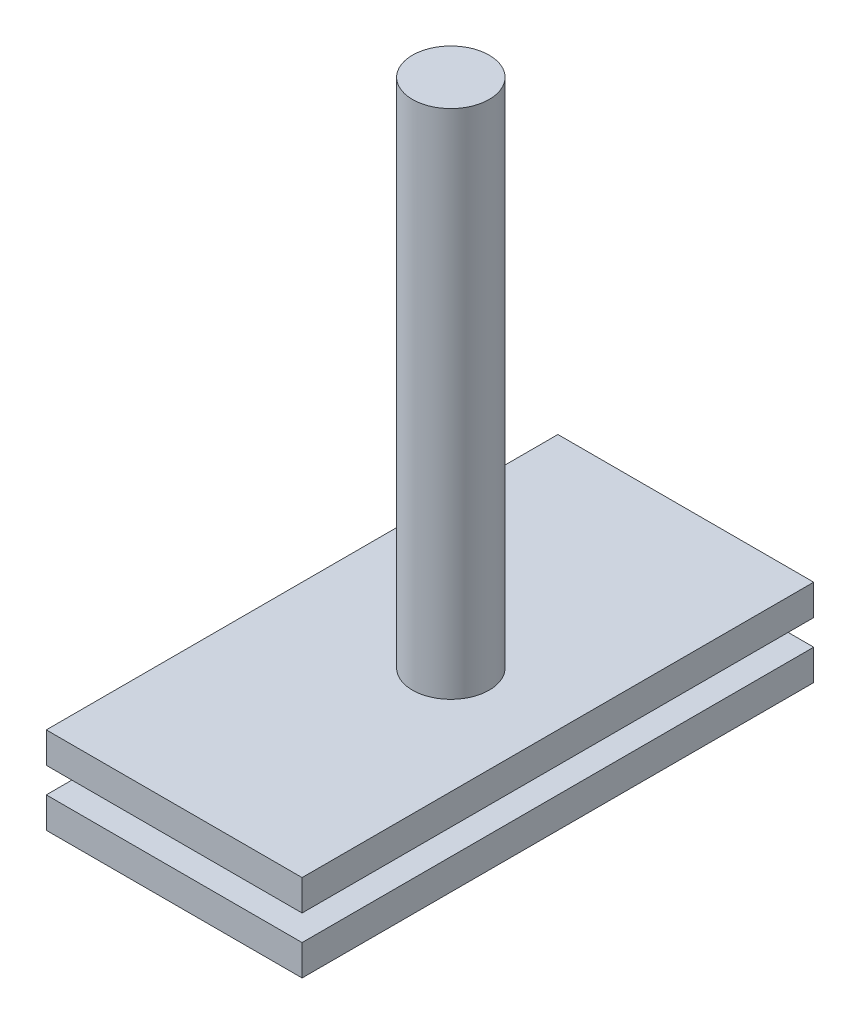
ISO-10303-21;
HEADER;
FILE_DESCRIPTION(('STEP AP214'),'2;1');
FILE_NAME('part.step','',(''),(''),'','','');
FILE_SCHEMA(('AUTOMOTIVE_DESIGN { 1 0 10303 214 1 1 1 1 }'));
ENDSEC;
DATA;
#1=APPLICATION_CONTEXT('core data for automotive mechanical design processes');
#2=APPLICATION_PROTOCOL_DEFINITION('international standard','automotive_design',2000,#1);
#3=PRODUCT_CONTEXT('',#1,'mechanical');
#4=PRODUCT('Part','Part','',(#3));
#5=PRODUCT_RELATED_PRODUCT_CATEGORY('part','',(#4));
#6=PRODUCT_DEFINITION_FORMATION('','',#4);
#7=PRODUCT_DEFINITION_CONTEXT('part definition',#1,'design');
#8=PRODUCT_DEFINITION('design','',#6,#7);
#9=PRODUCT_DEFINITION_SHAPE('','',#8);
#10=(LENGTH_UNIT() NAMED_UNIT(*) SI_UNIT(.MILLI.,.METRE.));
#11=(NAMED_UNIT(*) PLANE_ANGLE_UNIT() SI_UNIT($,.RADIAN.));
#12=(NAMED_UNIT(*) SI_UNIT($,.STERADIAN.) SOLID_ANGLE_UNIT());
#13=UNCERTAINTY_MEASURE_WITH_UNIT(LENGTH_MEASURE(1.E-05),#10,'distance_accuracy_value','');
#14=(GEOMETRIC_REPRESENTATION_CONTEXT(3) GLOBAL_UNCERTAINTY_ASSIGNED_CONTEXT((#13)) GLOBAL_UNIT_ASSIGNED_CONTEXT((#10,
#11,#12)) REPRESENTATION_CONTEXT('',''));
#15=CARTESIAN_POINT('',(0.,0.,0.));
#16=DIRECTION('',(0.,0.,1.));
#17=DIRECTION('',(1.,0.,0.));
#18=AXIS2_PLACEMENT_3D('',#15,#16,#17);
#19=CARTESIAN_POINT('',(-10.,2.2,20.));
#20=DIRECTION('',(1.,0.,0.));
#21=DIRECTION('',(0.,0.,-1.));
#22=AXIS2_PLACEMENT_3D('',#19,#20,#21);
#23=PLANE('',#22);
#24=DIRECTION('',(0.,-1.,0.));
#25=VECTOR('',#24,1.);
#26=CARTESIAN_POINT('',(-10.,2.2,0.));
#27=LINE('',#26,#25);
#28=CARTESIAN_POINT('',(-10.,2.2,0.));
#29=VERTEX_POINT('',#28);
#30=CARTESIAN_POINT('',(-10.,0.999999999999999,0.));
#31=VERTEX_POINT('',#30);
#32=EDGE_CURVE('E110',#29,#31,#27,.T.);
#33=ORIENTED_EDGE('',*,*,#32,.T.);
#34=DIRECTION('',(0.,0.,-1.));
#35=VECTOR('',#34,1.);
#36=CARTESIAN_POINT('',(-10.,0.999999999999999,20.));
#37=LINE('',#36,#35);
#38=CARTESIAN_POINT('',(-10.,0.999999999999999,20.));
#39=VERTEX_POINT('',#38);
#40=EDGE_CURVE('E52',#39,#31,#37,.T.);
#41=ORIENTED_EDGE('',*,*,#40,.F.);
#42=DIRECTION('',(0.,-1.,0.));
#43=VECTOR('',#42,1.);
#44=CARTESIAN_POINT('',(-10.,2.2,20.));
#45=LINE('',#44,#43);
#46=CARTESIAN_POINT('',(-10.,2.2,20.));
#47=VERTEX_POINT('',#46);
#48=EDGE_CURVE('E96',#47,#39,#45,.T.);
#49=ORIENTED_EDGE('',*,*,#48,.F.);
#50=DIRECTION('',(0.,0.,-1.));
#51=VECTOR('',#50,1.);
#52=CARTESIAN_POINT('',(-10.,2.2,20.));
#53=LINE('',#52,#51);
#54=EDGE_CURVE('E106',#47,#29,#53,.T.);
#55=ORIENTED_EDGE('',*,*,#54,.T.);
#56=EDGE_LOOP('',(#33,#41,#49,#55));
#57=FACE_BOUND('',#56,.T.);
#58=ADVANCED_FACE('F44',(#57),#23,.F.);
#59=CARTESIAN_POINT('',(-10.,0.999999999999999,20.));
#60=DIRECTION('',(0.,1.,0.));
#61=DIRECTION('',(0.,0.,1.));
#62=AXIS2_PLACEMENT_3D('',#59,#60,#61);
#63=PLANE('',#62);
#64=DIRECTION('',(1.,0.,0.));
#65=VECTOR('',#64,1.);
#66=CARTESIAN_POINT('',(-10.,0.999999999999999,0.));
#67=LINE('',#66,#65);
#68=CARTESIAN_POINT('',(0.,0.999999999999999,0.));
#69=VERTEX_POINT('',#68);
#70=EDGE_CURVE('E101',#31,#69,#67,.T.);
#71=ORIENTED_EDGE('',*,*,#70,.T.);
#72=DIRECTION('',(0.,0.,-1.));
#73=VECTOR('',#72,1.);
#74=CARTESIAN_POINT('',(0.,0.999999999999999,20.));
#75=LINE('',#74,#73);
#76=CARTESIAN_POINT('',(0.,0.999999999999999,20.));
#77=VERTEX_POINT('',#76);
#78=EDGE_CURVE('E99',#77,#69,#75,.T.);
#79=ORIENTED_EDGE('',*,*,#78,.F.);
#80=DIRECTION('',(1.,0.,0.));
#81=VECTOR('',#80,1.);
#82=CARTESIAN_POINT('',(-10.,0.999999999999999,20.));
#83=LINE('',#82,#81);
#84=EDGE_CURVE('E91',#39,#77,#83,.T.);
#85=ORIENTED_EDGE('',*,*,#84,.F.);
#86=ORIENTED_EDGE('',*,*,#40,.T.);
#87=EDGE_LOOP('',(#71,#79,#85,#86));
#88=FACE_BOUND('',#87,.T.);
#89=ADVANCED_FACE('F100',(#88),#63,.F.);
#90=CARTESIAN_POINT('',(0.,2.2,20.));
#91=DIRECTION('',(-1.,0.,0.));
#92=DIRECTION('',(0.,-1.,0.));
#93=AXIS2_PLACEMENT_3D('',#90,#91,#92);
#94=PLANE('',#93);
#95=DIRECTION('',(0.,1.,0.));
#96=VECTOR('',#95,1.);
#97=CARTESIAN_POINT('',(0.,2.2,0.));
#98=LINE('',#97,#96);
#99=CARTESIAN_POINT('',(0.,2.2,0.));
#100=VERTEX_POINT('',#99);
#101=EDGE_CURVE('E77',#69,#100,#98,.T.);
#102=ORIENTED_EDGE('',*,*,#101,.T.);
#103=DIRECTION('',(0.,0.,-1.));
#104=VECTOR('',#103,1.);
#105=CARTESIAN_POINT('',(0.,2.2,20.));
#106=LINE('',#105,#104);
#107=CARTESIAN_POINT('',(0.,2.2,20.));
#108=VERTEX_POINT('',#107);
#109=EDGE_CURVE('E102',#108,#100,#106,.T.);
#110=ORIENTED_EDGE('',*,*,#109,.F.);
#111=DIRECTION('',(0.,1.,0.));
#112=VECTOR('',#111,1.);
#113=CARTESIAN_POINT('',(0.,2.2,20.));
#114=LINE('',#113,#112);
#115=EDGE_CURVE('E94',#77,#108,#114,.T.);
#116=ORIENTED_EDGE('',*,*,#115,.F.);
#117=ORIENTED_EDGE('',*,*,#78,.T.);
#118=EDGE_LOOP('',(#102,#110,#116,#117));
#119=FACE_BOUND('',#118,.T.);
#120=ADVANCED_FACE('F104',(#119),#94,.F.);
#121=CARTESIAN_POINT('',(-10.,2.2,20.));
#122=DIRECTION('',(0.,-1.,0.));
#123=DIRECTION('',(0.,0.,-1.));
#124=AXIS2_PLACEMENT_3D('',#121,#122,#123);
#125=PLANE('',#124);
#126=CARTESIAN_POINT('',(-4.18565696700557,2.2,10.));
#127=DIRECTION('',(0.,-1.,0.));
#128=DIRECTION('',(0.,0.,-1.));
#129=AXIS2_PLACEMENT_3D('',#126,#127,#128);
#130=CIRCLE('',#129,1.5);
#131=CARTESIAN_POINT('',(-4.18565696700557,2.2,8.5));
#132=VERTEX_POINT('',#131);
#133=EDGE_CURVE('E12',#132,#132,#130,.F.);
#134=ORIENTED_EDGE('',*,*,#133,.F.);
#135=EDGE_LOOP('',(#134));
#136=FACE_BOUND('',#135,.T.);
#137=DIRECTION('',(-1.,0.,0.));
#138=VECTOR('',#137,1.);
#139=CARTESIAN_POINT('',(-10.,2.2,0.));
#140=LINE('',#139,#138);
#141=EDGE_CURVE('E83',#100,#29,#140,.T.);
#142=ORIENTED_EDGE('',*,*,#141,.T.);
#143=ORIENTED_EDGE('',*,*,#54,.F.);
#144=DIRECTION('',(-1.,0.,0.));
#145=VECTOR('',#144,1.);
#146=CARTESIAN_POINT('',(-10.,2.2,20.));
#147=LINE('',#146,#145);
#148=EDGE_CURVE('E60',#108,#47,#147,.T.);
#149=ORIENTED_EDGE('',*,*,#148,.F.);
#150=ORIENTED_EDGE('',*,*,#109,.T.);
#151=EDGE_LOOP('',(#142,#143,#149,#150));
#152=FACE_BOUND('',#151,.T.);
#153=ADVANCED_FACE('F132',(#136,#152),#125,.F.);
#154=CARTESIAN_POINT('',(0.,0.,20.));
#155=DIRECTION('',(0.,0.,1.));
#156=DIRECTION('',(1.,0.,0.));
#157=AXIS2_PLACEMENT_3D('',#154,#155,#156);
#158=PLANE('',#157);
#159=ORIENTED_EDGE('',*,*,#48,.T.);
#160=ORIENTED_EDGE('',*,*,#84,.T.);
#161=ORIENTED_EDGE('',*,*,#115,.T.);
#162=ORIENTED_EDGE('',*,*,#148,.T.);
#163=EDGE_LOOP('',(#159,#160,#161,#162));
#164=FACE_BOUND('',#163,.T.);
#165=ADVANCED_FACE('F92',(#164),#158,.T.);
#166=CARTESIAN_POINT('',(0.,0.,0.));
#167=DIRECTION('',(0.,0.,1.));
#168=DIRECTION('',(1.,0.,0.));
#169=AXIS2_PLACEMENT_3D('',#166,#167,#168);
#170=PLANE('',#169);
#171=ORIENTED_EDGE('',*,*,#32,.F.);
#172=ORIENTED_EDGE('',*,*,#141,.F.);
#173=ORIENTED_EDGE('',*,*,#101,.F.);
#174=ORIENTED_EDGE('',*,*,#70,.F.);
#175=EDGE_LOOP('',(#171,#172,#173,#174));
#176=FACE_BOUND('',#175,.T.);
#177=ADVANCED_FACE('F121',(#176),#170,.F.);
#178=CARTESIAN_POINT('',(-4.18565696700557,22.2,10.));
#179=DIRECTION('',(0.,-1.,0.));
#180=DIRECTION('',(0.,0.,-1.));
#181=AXIS2_PLACEMENT_3D('',#178,#179,#180);
#182=CYLINDRICAL_SURFACE('',#181,1.5);
#183=CARTESIAN_POINT('',(-4.18565696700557,22.2,10.));
#184=DIRECTION('',(0.,1.,0.));
#185=DIRECTION('',(0.,0.,1.));
#186=AXIS2_PLACEMENT_3D('',#183,#184,#185);
#187=CIRCLE('',#186,1.5);
#188=CARTESIAN_POINT('',(-4.18565696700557,22.2,11.5));
#189=VERTEX_POINT('',#188);
#190=EDGE_CURVE('E113',#189,#189,#187,.T.);
#191=ORIENTED_EDGE('',*,*,#190,.F.);
#192=EDGE_LOOP('',(#191));
#193=FACE_BOUND('',#192,.T.);
#194=ORIENTED_EDGE('',*,*,#133,.T.);
#195=EDGE_LOOP('',(#194));
#196=FACE_BOUND('',#195,.T.);
#197=ADVANCED_FACE('F123',(#193,#196),#182,.T.);
#198=CARTESIAN_POINT('',(-4.18565696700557,22.2,10.));
#199=DIRECTION('',(0.,1.,0.));
#200=DIRECTION('',(0.,0.,1.));
#201=AXIS2_PLACEMENT_3D('',#198,#199,#200);
#202=PLANE('',#201);
#203=ORIENTED_EDGE('',*,*,#190,.T.);
#204=EDGE_LOOP('',(#203));
#205=FACE_BOUND('',#204,.T.);
#206=ADVANCED_FACE('F129',(#205),#202,.T.);
#207=CLOSED_SHELL('',(#58,#89,#120,#153,#165,#177,#197,#206));
#208=MANIFOLD_SOLID_BREP('B2',#207);
#209=CARTESIAN_POINT('',(0.,0.,20.));
#210=DIRECTION('',(-1.,0.,0.));
#211=DIRECTION('',(0.,-1.,0.));
#212=AXIS2_PLACEMENT_3D('',#209,#210,#211);
#213=PLANE('',#212);
#214=DIRECTION('',(0.,1.,0.));
#215=VECTOR('',#214,1.);
#216=CARTESIAN_POINT('',(0.,0.,0.));
#217=LINE('',#216,#215);
#218=CARTESIAN_POINT('',(0.,-1.2,0.));
#219=VERTEX_POINT('',#218);
#220=CARTESIAN_POINT('',(0.,0.,0.));
#221=VERTEX_POINT('',#220);
#222=EDGE_CURVE('E260',#219,#221,#217,.T.);
#223=ORIENTED_EDGE('',*,*,#222,.T.);
#224=DIRECTION('',(0.,0.,-1.));
#225=VECTOR('',#224,1.);
#226=CARTESIAN_POINT('',(0.,0.,20.));
#227=LINE('',#226,#225);
#228=CARTESIAN_POINT('',(0.,0.,20.));
#229=VERTEX_POINT('',#228);
#230=EDGE_CURVE('E42',#229,#221,#227,.T.);
#231=ORIENTED_EDGE('',*,*,#230,.F.);
#232=DIRECTION('',(0.,1.,0.));
#233=VECTOR('',#232,1.);
#234=CARTESIAN_POINT('',(0.,0.,20.));
#235=LINE('',#234,#233);
#236=CARTESIAN_POINT('',(0.,-1.2,20.));
#237=VERTEX_POINT('',#236);
#238=EDGE_CURVE('E248',#237,#229,#235,.T.);
#239=ORIENTED_EDGE('',*,*,#238,.F.);
#240=DIRECTION('',(0.,0.,-1.));
#241=VECTOR('',#240,1.);
#242=CARTESIAN_POINT('',(0.,-1.2,20.));
#243=LINE('',#242,#241);
#244=EDGE_CURVE('E256',#237,#219,#243,.T.);
#245=ORIENTED_EDGE('',*,*,#244,.T.);
#246=EDGE_LOOP('',(#223,#231,#239,#245));
#247=FACE_BOUND('',#246,.T.);
#248=ADVANCED_FACE('F197',(#247),#213,.F.);
#249=CARTESIAN_POINT('',(0.,0.,20.));
#250=DIRECTION('',(0.,-1.,0.));
#251=DIRECTION('',(0.,0.,-1.));
#252=AXIS2_PLACEMENT_3D('',#249,#250,#251);
#253=PLANE('',#252);
#254=DIRECTION('',(-1.,0.,0.));
#255=VECTOR('',#254,1.);
#256=CARTESIAN_POINT('',(0.,0.,0.));
#257=LINE('',#256,#255);
#258=CARTESIAN_POINT('',(-10.,0.,0.));
#259=VERTEX_POINT('',#258);
#260=EDGE_CURVE('E252',#221,#259,#257,.T.);
#261=ORIENTED_EDGE('',*,*,#260,.T.);
#262=DIRECTION('',(0.,0.,-1.));
#263=VECTOR('',#262,1.);
#264=CARTESIAN_POINT('',(-10.,0.,20.));
#265=LINE('',#264,#263);
#266=CARTESIAN_POINT('',(-10.,0.,20.));
#267=VERTEX_POINT('',#266);
#268=EDGE_CURVE('E205',#267,#259,#265,.T.);
#269=ORIENTED_EDGE('',*,*,#268,.F.);
#270=DIRECTION('',(-1.,0.,0.));
#271=VECTOR('',#270,1.);
#272=CARTESIAN_POINT('',(0.,0.,20.));
#273=LINE('',#272,#271);
#274=EDGE_CURVE('E243',#229,#267,#273,.T.);
#275=ORIENTED_EDGE('',*,*,#274,.F.);
#276=ORIENTED_EDGE('',*,*,#230,.T.);
#277=EDGE_LOOP('',(#261,#269,#275,#276));
#278=FACE_BOUND('',#277,.T.);
#279=ADVANCED_FACE('F251',(#278),#253,.F.);
#280=CARTESIAN_POINT('',(-10.,0.,20.));
#281=DIRECTION('',(1.,0.,0.));
#282=DIRECTION('',(0.,0.,-1.));
#283=AXIS2_PLACEMENT_3D('',#280,#281,#282);
#284=PLANE('',#283);
#285=DIRECTION('',(0.,-1.,0.));
#286=VECTOR('',#285,1.);
#287=CARTESIAN_POINT('',(-10.,0.,0.));
#288=LINE('',#287,#286);
#289=CARTESIAN_POINT('',(-10.,-1.2,0.));
#290=VERTEX_POINT('',#289);
#291=EDGE_CURVE('E230',#259,#290,#288,.T.);
#292=ORIENTED_EDGE('',*,*,#291,.T.);
#293=DIRECTION('',(0.,0.,-1.));
#294=VECTOR('',#293,1.);
#295=CARTESIAN_POINT('',(-10.,-1.2,20.));
#296=LINE('',#295,#294);
#297=CARTESIAN_POINT('',(-10.,-1.2,20.));
#298=VERTEX_POINT('',#297);
#299=EDGE_CURVE('E253',#298,#290,#296,.T.);
#300=ORIENTED_EDGE('',*,*,#299,.F.);
#301=DIRECTION('',(0.,-1.,0.));
#302=VECTOR('',#301,1.);
#303=CARTESIAN_POINT('',(-10.,0.,20.));
#304=LINE('',#303,#302);
#305=EDGE_CURVE('E246',#267,#298,#304,.T.);
#306=ORIENTED_EDGE('',*,*,#305,.F.);
#307=ORIENTED_EDGE('',*,*,#268,.T.);
#308=EDGE_LOOP('',(#292,#300,#306,#307));
#309=FACE_BOUND('',#308,.T.);
#310=ADVANCED_FACE('F254',(#309),#284,.F.);
#311=CARTESIAN_POINT('',(0.,-1.2,20.));
#312=DIRECTION('',(0.,1.,0.));
#313=DIRECTION('',(-1.,0.,0.));
#314=AXIS2_PLACEMENT_3D('',#311,#312,#313);
#315=PLANE('',#314);
#316=DIRECTION('',(1.,0.,0.));
#317=VECTOR('',#316,1.);
#318=CARTESIAN_POINT('',(0.,-1.2,0.));
#319=LINE('',#318,#317);
#320=EDGE_CURVE('E236',#290,#219,#319,.T.);
#321=ORIENTED_EDGE('',*,*,#320,.T.);
#322=ORIENTED_EDGE('',*,*,#244,.F.);
#323=DIRECTION('',(1.,0.,0.));
#324=VECTOR('',#323,1.);
#325=CARTESIAN_POINT('',(0.,-1.2,20.));
#326=LINE('',#325,#324);
#327=EDGE_CURVE('E213',#298,#237,#326,.T.);
#328=ORIENTED_EDGE('',*,*,#327,.F.);
#329=ORIENTED_EDGE('',*,*,#299,.T.);
#330=EDGE_LOOP('',(#321,#322,#328,#329));
#331=FACE_BOUND('',#330,.T.);
#332=ADVANCED_FACE('F267',(#331),#315,.F.);
#333=CARTESIAN_POINT('',(0.,0.,20.));
#334=DIRECTION('',(0.,0.,-1.));
#335=DIRECTION('',(-1.,0.,0.));
#336=AXIS2_PLACEMENT_3D('',#333,#334,#335);
#337=PLANE('',#336);
#338=ORIENTED_EDGE('',*,*,#238,.T.);
#339=ORIENTED_EDGE('',*,*,#274,.T.);
#340=ORIENTED_EDGE('',*,*,#305,.T.);
#341=ORIENTED_EDGE('',*,*,#327,.T.);
#342=EDGE_LOOP('',(#338,#339,#340,#341));
#343=FACE_BOUND('',#342,.T.);
#344=ADVANCED_FACE('F244',(#343),#337,.F.);
#345=CARTESIAN_POINT('',(0.,0.,0.));
#346=DIRECTION('',(0.,0.,-1.));
#347=DIRECTION('',(-1.,0.,0.));
#348=AXIS2_PLACEMENT_3D('',#345,#346,#347);
#349=PLANE('',#348);
#350=ORIENTED_EDGE('',*,*,#222,.F.);
#351=ORIENTED_EDGE('',*,*,#320,.F.);
#352=ORIENTED_EDGE('',*,*,#291,.F.);
#353=ORIENTED_EDGE('',*,*,#260,.F.);
#354=EDGE_LOOP('',(#350,#351,#352,#353));
#355=FACE_BOUND('',#354,.T.);
#356=ADVANCED_FACE('F270',(#355),#349,.T.);
#357=CLOSED_SHELL('',(#248,#279,#310,#332,#344,#356));
#358=MANIFOLD_SOLID_BREP('B6',#357);
#359=ADVANCED_BREP_SHAPE_REPRESENTATION('',(#18,#208,#358),#14);
#360=SHAPE_DEFINITION_REPRESENTATION(#9,#359);
ENDSEC;
END-ISO-10303-21;
